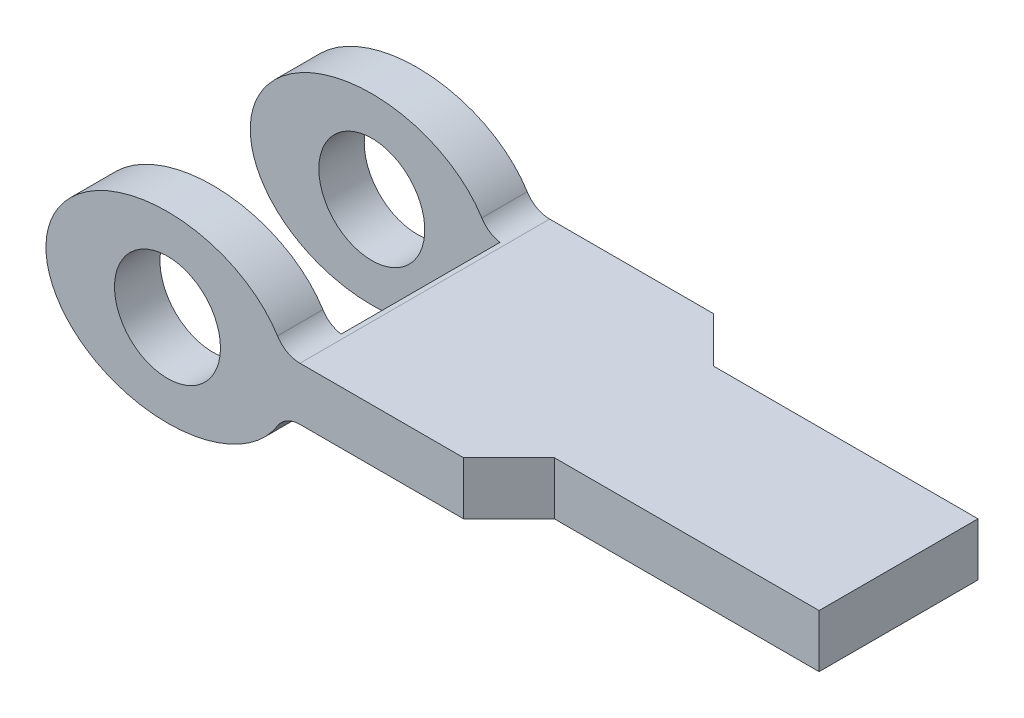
ISO-10303-21;
HEADER;
FILE_DESCRIPTION(('STEP AP214'),'2;1');
FILE_NAME('part.step','',(''),(''),'','','');
FILE_SCHEMA(('AUTOMOTIVE_DESIGN { 1 0 10303 214 1 1 1 1 }'));
ENDSEC;
DATA;
#1=APPLICATION_CONTEXT('core data for automotive mechanical design processes');
#2=APPLICATION_PROTOCOL_DEFINITION('international standard','automotive_design',2000,#1);
#3=PRODUCT_CONTEXT('',#1,'mechanical');
#4=PRODUCT('Part','Part','',(#3));
#5=PRODUCT_RELATED_PRODUCT_CATEGORY('part','',(#4));
#6=PRODUCT_DEFINITION_FORMATION('','',#4);
#7=PRODUCT_DEFINITION_CONTEXT('part definition',#1,'design');
#8=PRODUCT_DEFINITION('design','',#6,#7);
#9=PRODUCT_DEFINITION_SHAPE('','',#8);
#10=(LENGTH_UNIT() NAMED_UNIT(*) SI_UNIT(.MILLI.,.METRE.));
#11=(NAMED_UNIT(*) PLANE_ANGLE_UNIT() SI_UNIT($,.RADIAN.));
#12=(NAMED_UNIT(*) SI_UNIT($,.STERADIAN.) SOLID_ANGLE_UNIT());
#13=UNCERTAINTY_MEASURE_WITH_UNIT(LENGTH_MEASURE(1.E-05),#10,'distance_accuracy_value','');
#14=(GEOMETRIC_REPRESENTATION_CONTEXT(3) GLOBAL_UNCERTAINTY_ASSIGNED_CONTEXT((#13)) GLOBAL_UNIT_ASSIGNED_CONTEXT((#10,
#11,#12)) REPRESENTATION_CONTEXT('',''));
#15=CARTESIAN_POINT('',(0.,0.,0.));
#16=DIRECTION('',(0.,0.,1.));
#17=DIRECTION('',(1.,0.,0.));
#18=AXIS2_PLACEMENT_3D('',#15,#16,#17);
#19=CARTESIAN_POINT('',(0.,0.,9.42857142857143));
#20=DIRECTION('',(0.,0.,1.));
#21=DIRECTION('',(-1.,0.,0.));
#22=AXIS2_PLACEMENT_3D('',#19,#20,#21);
#23=ELLIPSE('',#22,9.17796127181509,6.91666666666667);
#24=DIRECTION('',(0.,0.,-1.));
#25=VECTOR('',#24,1.);
#26=SURFACE_OF_LINEAR_EXTRUSION('',#23,#25);
#27=CARTESIAN_POINT('',(0.,0.,-6.));
#28=DIRECTION('',(0.,0.,1.));
#29=DIRECTION('',(-1.,0.,0.));
#30=AXIS2_PLACEMENT_3D('',#27,#28,#29);
#31=ELLIPSE('',#30,9.17796127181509,6.91666666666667);
#32=CARTESIAN_POINT('',(8.30648200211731,-2.94174524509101,-6.));
#33=VERTEX_POINT('',#32);
#34=CARTESIAN_POINT('',(8.30648200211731,2.94174524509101,-6.));
#35=VERTEX_POINT('',#34);
#36=EDGE_CURVE('E171',#33,#35,#31,.F.);
#37=ORIENTED_EDGE('',*,*,#36,.T.);
#38=DIRECTION('',(0.,0.,-1.));
#39=VECTOR('',#38,1.);
#40=CARTESIAN_POINT('',(8.30648200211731,2.94174524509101,9.42857142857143));
#41=LINE('',#40,#39);
#42=CARTESIAN_POINT('',(8.30648200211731,2.94174524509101,-9.42857142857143));
#43=VERTEX_POINT('',#42);
#44=EDGE_CURVE('E278',#35,#43,#41,.T.);
#45=ORIENTED_EDGE('',*,*,#44,.T.);
#46=CARTESIAN_POINT('',(0.,0.,-9.42857142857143));
#47=DIRECTION('',(0.,0.,1.));
#48=DIRECTION('',(-1.,0.,0.));
#49=AXIS2_PLACEMENT_3D('',#46,#47,#48);
#50=ELLIPSE('',#49,9.17796127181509,6.91666666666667);
#51=CARTESIAN_POINT('',(8.30648200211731,-2.94174524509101,-9.42857142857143));
#52=VERTEX_POINT('',#51);
#53=EDGE_CURVE('E232',#43,#52,#50,.T.);
#54=ORIENTED_EDGE('',*,*,#53,.T.);
#55=DIRECTION('',(0.,0.,-1.));
#56=VECTOR('',#55,1.);
#57=CARTESIAN_POINT('',(8.30648200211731,-2.94174524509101,9.42857142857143));
#58=LINE('',#57,#56);
#59=EDGE_CURVE('E242',#33,#52,#58,.T.);
#60=ORIENTED_EDGE('',*,*,#59,.F.);
#61=EDGE_LOOP('',(#37,#45,#54,#60));
#62=FACE_BOUND('',#61,.T.);
#63=ADVANCED_FACE('F32',(#62),#26,.F.);
#64=CARTESIAN_POINT('',(0.,0.,9.42857142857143));
#65=DIRECTION('',(0.,0.,-1.));
#66=DIRECTION('',(-1.,0.,0.));
#67=AXIS2_PLACEMENT_3D('',#64,#65,#66);
#68=CYLINDRICAL_SURFACE('',#67,4.);
#69=CARTESIAN_POINT('',(0.,0.,-6.));
#70=DIRECTION('',(0.,0.,-1.));
#71=DIRECTION('',(-1.,0.,0.));
#72=AXIS2_PLACEMENT_3D('',#69,#70,#71);
#73=CIRCLE('',#72,4.);
#74=CARTESIAN_POINT('',(-4.,0.,-6.));
#75=VERTEX_POINT('',#74);
#76=EDGE_CURVE('E168',#75,#75,#73,.T.);
#77=ORIENTED_EDGE('',*,*,#76,.F.);
#78=EDGE_LOOP('',(#77));
#79=FACE_BOUND('',#78,.T.);
#80=CARTESIAN_POINT('',(0.,0.,-9.42857142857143));
#81=DIRECTION('',(0.,0.,1.));
#82=DIRECTION('',(1.,0.,0.));
#83=AXIS2_PLACEMENT_3D('',#80,#81,#82);
#84=CIRCLE('',#83,4.);
#85=CARTESIAN_POINT('',(4.,0.,-9.42857142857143));
#86=VERTEX_POINT('',#85);
#87=EDGE_CURVE('E221',#86,#86,#84,.T.);
#88=ORIENTED_EDGE('',*,*,#87,.F.);
#89=EDGE_LOOP('',(#88));
#90=FACE_BOUND('',#89,.T.);
#91=ADVANCED_FACE('F266',(#79,#90),#68,.F.);
#92=CARTESIAN_POINT('',(0.,0.,9.42857142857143));
#93=DIRECTION('',(0.,0.,1.));
#94=DIRECTION('',(1.,0.,0.));
#95=AXIS2_PLACEMENT_3D('',#92,#93,#94);
#96=PLANE('',#95);
#97=DIRECTION('',(0.,1.,0.));
#98=VECTOR('',#97,1.);
#99=CARTESIAN_POINT('',(22.3559225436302,-6.91666666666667,9.42857142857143));
#100=LINE('',#99,#98);
#101=CARTESIAN_POINT('',(22.3559225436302,-2.,9.42857142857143));
#102=VERTEX_POINT('',#101);
#103=CARTESIAN_POINT('',(22.3559225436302,2.,9.42857142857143));
#104=VERTEX_POINT('',#103);
#105=EDGE_CURVE('E140',#102,#104,#100,.T.);
#106=ORIENTED_EDGE('',*,*,#105,.T.);
#107=DIRECTION('',(-1.,0.,0.));
#108=VECTOR('',#107,1.);
#109=CARTESIAN_POINT('',(10.0035668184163,2.,9.42857142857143));
#110=LINE('',#109,#108);
#111=CARTESIAN_POINT('',(10.0035668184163,2.,9.42857142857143));
#112=VERTEX_POINT('',#111);
#113=EDGE_CURVE('E235',#104,#112,#110,.T.);
#114=ORIENTED_EDGE('',*,*,#113,.T.);
#115=CARTESIAN_POINT('',(10.0035668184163,4.,9.42857142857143));
#116=DIRECTION('',(0.,0.,-1.));
#117=DIRECTION('',(-1.,0.,0.));
#118=AXIS2_PLACEMENT_3D('',#115,#116,#117);
#119=CIRCLE('',#118,2.);
#120=CARTESIAN_POINT('',(8.30648200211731,2.94174524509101,9.42857142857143));
#121=VERTEX_POINT('',#120);
#122=EDGE_CURVE('E237',#112,#121,#119,.T.);
#123=ORIENTED_EDGE('',*,*,#122,.T.);
#124=CARTESIAN_POINT('',(8.30648200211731,-2.94174524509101,9.42857142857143));
#125=VERTEX_POINT('',#124);
#126=EDGE_CURVE('E239',#121,#125,#23,.T.);
#127=ORIENTED_EDGE('',*,*,#126,.T.);
#128=CARTESIAN_POINT('',(10.0035668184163,-4.,9.42857142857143));
#129=DIRECTION('',(0.,0.,-1.));
#130=DIRECTION('',(1.,0.,0.));
#131=AXIS2_PLACEMENT_3D('',#128,#129,#130);
#132=CIRCLE('',#131,2.);
#133=CARTESIAN_POINT('',(10.0035668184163,-2.,9.42857142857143));
#134=VERTEX_POINT('',#133);
#135=EDGE_CURVE('E228',#125,#134,#132,.T.);
#136=ORIENTED_EDGE('',*,*,#135,.T.);
#137=DIRECTION('',(1.,0.,0.));
#138=VECTOR('',#137,1.);
#139=CARTESIAN_POINT('',(45.7767491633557,-2.,9.42857142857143));
#140=LINE('',#139,#138);
#141=EDGE_CURVE('E231',#134,#102,#140,.T.);
#142=ORIENTED_EDGE('',*,*,#141,.T.);
#143=EDGE_LOOP('',(#106,#114,#123,#127,#136,#142));
#144=FACE_BOUND('',#143,.T.);
#145=CARTESIAN_POINT('',(0.,0.,9.42857142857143));
#146=DIRECTION('',(0.,0.,1.));
#147=DIRECTION('',(1.,0.,0.));
#148=AXIS2_PLACEMENT_3D('',#145,#146,#147);
#149=CIRCLE('',#148,4.);
#150=CARTESIAN_POINT('',(4.,0.,9.42857142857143));
#151=VERTEX_POINT('',#150);
#152=EDGE_CURVE('E222',#151,#151,#149,.T.);
#153=ORIENTED_EDGE('',*,*,#152,.F.);
#154=EDGE_LOOP('',(#153));
#155=FACE_BOUND('',#154,.T.);
#156=ADVANCED_FACE('F271',(#144,#155),#96,.T.);
#157=CARTESIAN_POINT('',(0.,0.,-9.42857142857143));
#158=DIRECTION('',(0.,0.,1.));
#159=DIRECTION('',(1.,0.,0.));
#160=AXIS2_PLACEMENT_3D('',#157,#158,#159);
#161=PLANE('',#160);
#162=DIRECTION('',(-1.,0.,0.));
#163=VECTOR('',#162,1.);
#164=CARTESIAN_POINT('',(10.0035668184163,2.,-9.42857142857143));
#165=LINE('',#164,#163);
#166=CARTESIAN_POINT('',(22.3559225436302,2.,-9.42857142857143));
#167=VERTEX_POINT('',#166);
#168=CARTESIAN_POINT('',(10.0035668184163,2.,-9.42857142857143));
#169=VERTEX_POINT('',#168);
#170=EDGE_CURVE('E300',#167,#169,#165,.T.);
#171=ORIENTED_EDGE('',*,*,#170,.F.);
#172=DIRECTION('',(0.,1.,0.));
#173=VECTOR('',#172,1.);
#174=CARTESIAN_POINT('',(22.3559225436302,-6.91666666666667,-9.42857142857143));
#175=LINE('',#174,#173);
#176=CARTESIAN_POINT('',(22.3559225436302,-2.,-9.42857142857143));
#177=VERTEX_POINT('',#176);
#178=EDGE_CURVE('E55',#177,#167,#175,.T.);
#179=ORIENTED_EDGE('',*,*,#178,.F.);
#180=DIRECTION('',(1.,0.,0.));
#181=VECTOR('',#180,1.);
#182=CARTESIAN_POINT('',(45.7767491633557,-2.,-9.42857142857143));
#183=LINE('',#182,#181);
#184=CARTESIAN_POINT('',(10.0035668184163,-2.,-9.42857142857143));
#185=VERTEX_POINT('',#184);
#186=EDGE_CURVE('E303',#185,#177,#183,.T.);
#187=ORIENTED_EDGE('',*,*,#186,.F.);
#188=CARTESIAN_POINT('',(10.0035668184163,-4.,-9.42857142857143));
#189=DIRECTION('',(0.,0.,-1.));
#190=DIRECTION('',(1.,0.,0.));
#191=AXIS2_PLACEMENT_3D('',#188,#189,#190);
#192=CIRCLE('',#191,2.);
#193=EDGE_CURVE('E225',#52,#185,#192,.T.);
#194=ORIENTED_EDGE('',*,*,#193,.F.);
#195=ORIENTED_EDGE('',*,*,#53,.F.);
#196=CARTESIAN_POINT('',(10.0035668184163,4.,-9.42857142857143));
#197=DIRECTION('',(0.,0.,-1.));
#198=DIRECTION('',(-1.,0.,0.));
#199=AXIS2_PLACEMENT_3D('',#196,#197,#198);
#200=CIRCLE('',#199,2.);
#201=EDGE_CURVE('E285',#169,#43,#200,.T.);
#202=ORIENTED_EDGE('',*,*,#201,.F.);
#203=EDGE_LOOP('',(#171,#179,#187,#194,#195,#202));
#204=FACE_BOUND('',#203,.T.);
#205=ORIENTED_EDGE('',*,*,#87,.T.);
#206=EDGE_LOOP('',(#205));
#207=FACE_BOUND('',#206,.T.);
#208=ADVANCED_FACE('F252',(#204,#207),#161,.F.);
#209=CARTESIAN_POINT('',(10.0035668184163,-4.,9.42857142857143));
#210=DIRECTION('',(0.,0.,-1.));
#211=DIRECTION('',(-1.,0.,0.));
#212=AXIS2_PLACEMENT_3D('',#209,#210,#211);
#213=CYLINDRICAL_SURFACE('',#212,2.);
#214=DIRECTION('',(0.,0.,-1.));
#215=VECTOR('',#214,1.);
#216=CARTESIAN_POINT('',(9.67796127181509,-2.02668273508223,9.42857142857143));
#217=LINE('',#216,#215);
#218=CARTESIAN_POINT('',(9.67796127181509,-2.02668273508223,6.));
#219=VERTEX_POINT('',#218);
#220=CARTESIAN_POINT('',(9.67796127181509,-2.02668273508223,-6.));
#221=VERTEX_POINT('',#220);
#222=EDGE_CURVE('E218',#219,#221,#217,.T.);
#223=ORIENTED_EDGE('',*,*,#222,.T.);
#224=CARTESIAN_POINT('',(10.0035668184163,-4.,-6.));
#225=DIRECTION('',(0.,0.,-1.));
#226=DIRECTION('',(-1.,0.,0.));
#227=AXIS2_PLACEMENT_3D('',#224,#225,#226);
#228=CIRCLE('',#227,2.);
#229=EDGE_CURVE('E215',#221,#33,#228,.F.);
#230=ORIENTED_EDGE('',*,*,#229,.T.);
#231=ORIENTED_EDGE('',*,*,#59,.T.);
#232=ORIENTED_EDGE('',*,*,#193,.T.);
#233=DIRECTION('',(0.,0.,-1.));
#234=VECTOR('',#233,1.);
#235=CARTESIAN_POINT('',(10.0035668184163,-2.,9.42857142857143));
#236=LINE('',#235,#234);
#237=EDGE_CURVE('E154',#134,#185,#236,.T.);
#238=ORIENTED_EDGE('',*,*,#237,.F.);
#239=ORIENTED_EDGE('',*,*,#135,.F.);
#240=CARTESIAN_POINT('',(8.30648200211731,-2.94174524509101,6.));
#241=VERTEX_POINT('',#240);
#242=EDGE_CURVE('E288',#125,#241,#58,.T.);
#243=ORIENTED_EDGE('',*,*,#242,.T.);
#244=CARTESIAN_POINT('',(10.0035668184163,-4.,6.));
#245=DIRECTION('',(0.,0.,1.));
#246=DIRECTION('',(1.,0.,0.));
#247=AXIS2_PLACEMENT_3D('',#244,#245,#246);
#248=CIRCLE('',#247,2.);
#249=EDGE_CURVE('E172',#241,#219,#248,.F.);
#250=ORIENTED_EDGE('',*,*,#249,.T.);
#251=EDGE_LOOP('',(#223,#230,#231,#232,#238,#239,#243,#250));
#252=FACE_BOUND('',#251,.T.);
#253=ADVANCED_FACE('F34',(#252),#213,.F.);
#254=CARTESIAN_POINT('',(45.7767491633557,-2.,9.42857142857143));
#255=DIRECTION('',(0.,1.,0.));
#256=DIRECTION('',(0.,0.,1.));
#257=AXIS2_PLACEMENT_3D('',#254,#255,#256);
#258=PLANE('',#257);
#259=DIRECTION('',(-1.,0.,0.));
#260=VECTOR('',#259,1.);
#261=CARTESIAN_POINT('',(45.7767491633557,-2.,6.));
#262=LINE('',#261,#260);
#263=CARTESIAN_POINT('',(45.7767491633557,-2.,6.));
#264=VERTEX_POINT('',#263);
#265=CARTESIAN_POINT('',(25.7844939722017,-2.,6.));
#266=VERTEX_POINT('',#265);
#267=EDGE_CURVE('E132',#264,#266,#262,.T.);
#268=ORIENTED_EDGE('',*,*,#267,.T.);
#269=DIRECTION('',(-0.707106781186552,0.,0.707106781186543));
#270=VECTOR('',#269,1.);
#271=CARTESIAN_POINT('',(34.0663358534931,-2.,-2.28184188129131));
#272=LINE('',#271,#270);
#273=EDGE_CURVE('E139',#266,#102,#272,.T.);
#274=ORIENTED_EDGE('',*,*,#273,.T.);
#275=ORIENTED_EDGE('',*,*,#141,.F.);
#276=ORIENTED_EDGE('',*,*,#237,.T.);
#277=ORIENTED_EDGE('',*,*,#186,.T.);
#278=DIRECTION('',(0.707106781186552,0.,0.707106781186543));
#279=VECTOR('',#278,1.);
#280=CARTESIAN_POINT('',(43.4949072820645,-2.,11.7104133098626));
#281=LINE('',#280,#279);
#282=CARTESIAN_POINT('',(25.7844939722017,-2.,-6.));
#283=VERTEX_POINT('',#282);
#284=EDGE_CURVE('E192',#177,#283,#281,.T.);
#285=ORIENTED_EDGE('',*,*,#284,.T.);
#286=DIRECTION('',(1.,0.,0.));
#287=VECTOR('',#286,1.);
#288=CARTESIAN_POINT('',(45.7767491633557,-2.,-6.));
#289=LINE('',#288,#287);
#290=CARTESIAN_POINT('',(45.7767491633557,-2.,-6.));
#291=VERTEX_POINT('',#290);
#292=EDGE_CURVE('E153',#283,#291,#289,.T.);
#293=ORIENTED_EDGE('',*,*,#292,.T.);
#294=DIRECTION('',(0.,0.,-1.));
#295=VECTOR('',#294,1.);
#296=CARTESIAN_POINT('',(45.7767491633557,-2.,9.42857142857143));
#297=LINE('',#296,#295);
#298=EDGE_CURVE('E146',#264,#291,#297,.T.);
#299=ORIENTED_EDGE('',*,*,#298,.F.);
#300=EDGE_LOOP('',(#268,#274,#275,#276,#277,#285,#293,#299));
#301=FACE_BOUND('',#300,.T.);
#302=ADVANCED_FACE('F151',(#301),#258,.F.);
#303=CARTESIAN_POINT('',(45.7767491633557,2.,9.42857142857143));
#304=DIRECTION('',(-1.,0.,0.));
#305=DIRECTION('',(0.,0.,1.));
#306=AXIS2_PLACEMENT_3D('',#303,#304,#305);
#307=PLANE('',#306);
#308=DIRECTION('',(0.,0.,-1.));
#309=VECTOR('',#308,1.);
#310=CARTESIAN_POINT('',(45.7767491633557,2.,9.42857142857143));
#311=LINE('',#310,#309);
#312=CARTESIAN_POINT('',(45.7767491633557,2.,6.));
#313=VERTEX_POINT('',#312);
#314=CARTESIAN_POINT('',(45.7767491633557,2.,-6.));
#315=VERTEX_POINT('',#314);
#316=EDGE_CURVE('E148',#313,#315,#311,.T.);
#317=ORIENTED_EDGE('',*,*,#316,.F.);
#318=DIRECTION('',(0.,1.,0.));
#319=VECTOR('',#318,1.);
#320=CARTESIAN_POINT('',(45.7767491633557,-6.91666666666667,6.));
#321=LINE('',#320,#319);
#322=EDGE_CURVE('E47',#264,#313,#321,.T.);
#323=ORIENTED_EDGE('',*,*,#322,.F.);
#324=ORIENTED_EDGE('',*,*,#298,.T.);
#325=DIRECTION('',(0.,1.,0.));
#326=VECTOR('',#325,1.);
#327=CARTESIAN_POINT('',(45.7767491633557,-6.91666666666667,-6.));
#328=LINE('',#327,#326);
#329=EDGE_CURVE('E190',#291,#315,#328,.T.);
#330=ORIENTED_EDGE('',*,*,#329,.T.);
#331=EDGE_LOOP('',(#317,#323,#324,#330));
#332=FACE_BOUND('',#331,.T.);
#333=ADVANCED_FACE('F144',(#332),#307,.F.);
#334=CARTESIAN_POINT('',(10.0035668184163,2.,9.42857142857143));
#335=DIRECTION('',(0.,-1.,0.));
#336=DIRECTION('',(0.,0.,-1.));
#337=AXIS2_PLACEMENT_3D('',#334,#335,#336);
#338=PLANE('',#337);
#339=ORIENTED_EDGE('',*,*,#113,.F.);
#340=DIRECTION('',(0.707106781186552,0.,-0.707106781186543));
#341=VECTOR('',#340,1.);
#342=CARTESIAN_POINT('',(16.1797446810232,2.,15.6047492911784));
#343=LINE('',#342,#341);
#344=CARTESIAN_POINT('',(25.7844939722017,2.,6.));
#345=VERTEX_POINT('',#344);
#346=EDGE_CURVE('E11',#104,#345,#343,.T.);
#347=ORIENTED_EDGE('',*,*,#346,.T.);
#348=DIRECTION('',(1.,0.,0.));
#349=VECTOR('',#348,1.);
#350=CARTESIAN_POINT('',(10.0035668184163,2.,6.));
#351=LINE('',#350,#349);
#352=EDGE_CURVE('E40',#345,#313,#351,.T.);
#353=ORIENTED_EDGE('',*,*,#352,.T.);
#354=ORIENTED_EDGE('',*,*,#316,.T.);
#355=DIRECTION('',(-1.,0.,0.));
#356=VECTOR('',#355,1.);
#357=CARTESIAN_POINT('',(10.0035668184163,2.,-6.));
#358=LINE('',#357,#356);
#359=CARTESIAN_POINT('',(25.7844939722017,2.,-6.));
#360=VERTEX_POINT('',#359);
#361=EDGE_CURVE('E177',#315,#360,#358,.T.);
#362=ORIENTED_EDGE('',*,*,#361,.T.);
#363=DIRECTION('',(-0.707106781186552,0.,-0.707106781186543));
#364=VECTOR('',#363,1.);
#365=CARTESIAN_POINT('',(25.6083161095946,2.,-6.17617786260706));
#366=LINE('',#365,#364);
#367=EDGE_CURVE('E175',#360,#167,#366,.T.);
#368=ORIENTED_EDGE('',*,*,#367,.T.);
#369=ORIENTED_EDGE('',*,*,#170,.T.);
#370=DIRECTION('',(0.,0.,-1.));
#371=VECTOR('',#370,1.);
#372=CARTESIAN_POINT('',(10.0035668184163,2.,9.42857142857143));
#373=LINE('',#372,#371);
#374=EDGE_CURVE('E159',#112,#169,#373,.T.);
#375=ORIENTED_EDGE('',*,*,#374,.F.);
#376=EDGE_LOOP('',(#339,#347,#353,#354,#362,#368,#369,#375));
#377=FACE_BOUND('',#376,.T.);
#378=ADVANCED_FACE('F181',(#377),#338,.F.);
#379=CARTESIAN_POINT('',(10.0035668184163,4.,9.42857142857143));
#380=DIRECTION('',(0.,0.,-1.));
#381=DIRECTION('',(-1.,0.,0.));
#382=AXIS2_PLACEMENT_3D('',#379,#380,#381);
#383=CYLINDRICAL_SURFACE('',#382,2.);
#384=ORIENTED_EDGE('',*,*,#44,.F.);
#385=CARTESIAN_POINT('',(10.0035668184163,4.,-6.));
#386=DIRECTION('',(0.,0.,-1.));
#387=DIRECTION('',(-1.,0.,0.));
#388=AXIS2_PLACEMENT_3D('',#385,#386,#387);
#389=CIRCLE('',#388,2.);
#390=CARTESIAN_POINT('',(9.67796127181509,2.02668273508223,-6.));
#391=VERTEX_POINT('',#390);
#392=EDGE_CURVE('E212',#35,#391,#389,.F.);
#393=ORIENTED_EDGE('',*,*,#392,.T.);
#394=DIRECTION('',(0.,0.,-1.));
#395=VECTOR('',#394,1.);
#396=CARTESIAN_POINT('',(9.67796127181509,2.02668273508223,9.42857142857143));
#397=LINE('',#396,#395);
#398=CARTESIAN_POINT('',(9.67796127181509,2.02668273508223,6.));
#399=VERTEX_POINT('',#398);
#400=EDGE_CURVE('E157',#391,#399,#397,.F.);
#401=ORIENTED_EDGE('',*,*,#400,.T.);
#402=CARTESIAN_POINT('',(10.0035668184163,4.,6.));
#403=DIRECTION('',(0.,0.,1.));
#404=DIRECTION('',(1.,0.,0.));
#405=AXIS2_PLACEMENT_3D('',#402,#403,#404);
#406=CIRCLE('',#405,2.);
#407=CARTESIAN_POINT('',(8.30648200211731,2.94174524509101,6.));
#408=VERTEX_POINT('',#407);
#409=EDGE_CURVE('E206',#399,#408,#406,.F.);
#410=ORIENTED_EDGE('',*,*,#409,.T.);
#411=EDGE_CURVE('E287',#121,#408,#41,.T.);
#412=ORIENTED_EDGE('',*,*,#411,.F.);
#413=ORIENTED_EDGE('',*,*,#122,.F.);
#414=ORIENTED_EDGE('',*,*,#374,.T.);
#415=ORIENTED_EDGE('',*,*,#201,.T.);
#416=EDGE_LOOP('',(#384,#393,#401,#410,#412,#413,#414,#415));
#417=FACE_BOUND('',#416,.T.);
#418=ADVANCED_FACE('F250',(#417),#383,.F.);
#419=ORIENTED_EDGE('',*,*,#411,.T.);
#420=CARTESIAN_POINT('',(0.,0.,6.));
#421=DIRECTION('',(0.,0.,1.));
#422=DIRECTION('',(-1.,0.,0.));
#423=AXIS2_PLACEMENT_3D('',#420,#421,#422);
#424=ELLIPSE('',#423,9.17796127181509,6.91666666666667);
#425=EDGE_CURVE('E166',#408,#241,#424,.T.);
#426=ORIENTED_EDGE('',*,*,#425,.T.);
#427=ORIENTED_EDGE('',*,*,#242,.F.);
#428=ORIENTED_EDGE('',*,*,#126,.F.);
#429=EDGE_LOOP('',(#419,#426,#427,#428));
#430=FACE_BOUND('',#429,.T.);
#431=ADVANCED_FACE('F245',(#430),#26,.F.);
#432=CARTESIAN_POINT('',(0.,0.,6.));
#433=DIRECTION('',(0.,0.,1.));
#434=DIRECTION('',(1.,0.,0.));
#435=AXIS2_PLACEMENT_3D('',#432,#433,#434);
#436=CIRCLE('',#435,4.);
#437=CARTESIAN_POINT('',(4.,0.,6.));
#438=VERTEX_POINT('',#437);
#439=EDGE_CURVE('E163',#438,#438,#436,.T.);
#440=ORIENTED_EDGE('',*,*,#439,.F.);
#441=EDGE_LOOP('',(#440));
#442=FACE_BOUND('',#441,.T.);
#443=ORIENTED_EDGE('',*,*,#152,.T.);
#444=EDGE_LOOP('',(#443));
#445=FACE_BOUND('',#444,.T.);
#446=ADVANCED_FACE('F249',(#442,#445),#68,.F.);
#447=CARTESIAN_POINT('',(9.67796127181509,-6.91666666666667,6.));
#448=DIRECTION('',(1.,0.,0.));
#449=DIRECTION('',(0.,0.,-1.));
#450=AXIS2_PLACEMENT_3D('',#447,#448,#449);
#451=PLANE('',#450);
#452=DIRECTION('',(0.,1.,0.));
#453=VECTOR('',#452,1.);
#454=CARTESIAN_POINT('',(9.67796127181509,-6.91666666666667,6.));
#455=LINE('',#454,#453);
#456=EDGE_CURVE('E199',#219,#399,#455,.T.);
#457=ORIENTED_EDGE('',*,*,#456,.T.);
#458=ORIENTED_EDGE('',*,*,#400,.F.);
#459=DIRECTION('',(0.,1.,0.));
#460=VECTOR('',#459,1.);
#461=CARTESIAN_POINT('',(9.67796127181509,-6.91666666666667,-6.));
#462=LINE('',#461,#460);
#463=EDGE_CURVE('E167',#221,#391,#462,.T.);
#464=ORIENTED_EDGE('',*,*,#463,.F.);
#465=ORIENTED_EDGE('',*,*,#222,.F.);
#466=EDGE_LOOP('',(#457,#458,#464,#465));
#467=FACE_BOUND('',#466,.T.);
#468=ADVANCED_FACE('F317',(#467),#451,.F.);
#469=CARTESIAN_POINT('',(9.67796127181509,-6.91666666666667,-6.));
#470=DIRECTION('',(0.,0.,-1.));
#471=DIRECTION('',(-1.,0.,0.));
#472=AXIS2_PLACEMENT_3D('',#469,#470,#471);
#473=PLANE('',#472);
#474=ORIENTED_EDGE('',*,*,#76,.T.);
#475=EDGE_LOOP('',(#474));
#476=FACE_BOUND('',#475,.T.);
#477=ORIENTED_EDGE('',*,*,#463,.T.);
#478=ORIENTED_EDGE('',*,*,#392,.F.);
#479=ORIENTED_EDGE('',*,*,#36,.F.);
#480=ORIENTED_EDGE('',*,*,#229,.F.);
#481=EDGE_LOOP('',(#477,#478,#479,#480));
#482=FACE_BOUND('',#481,.T.);
#483=ADVANCED_FACE('F281',(#476,#482),#473,.F.);
#484=CARTESIAN_POINT('',(9.67796127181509,-6.91666666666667,6.));
#485=DIRECTION('',(0.,0.,1.));
#486=DIRECTION('',(1.,0.,0.));
#487=AXIS2_PLACEMENT_3D('',#484,#485,#486);
#488=PLANE('',#487);
#489=ORIENTED_EDGE('',*,*,#439,.T.);
#490=EDGE_LOOP('',(#489));
#491=FACE_BOUND('',#490,.T.);
#492=ORIENTED_EDGE('',*,*,#425,.F.);
#493=ORIENTED_EDGE('',*,*,#409,.F.);
#494=ORIENTED_EDGE('',*,*,#456,.F.);
#495=ORIENTED_EDGE('',*,*,#249,.F.);
#496=EDGE_LOOP('',(#492,#493,#494,#495));
#497=FACE_BOUND('',#496,.T.);
#498=ADVANCED_FACE('F314',(#491,#497),#488,.F.);
#499=CARTESIAN_POINT('',(25.7844939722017,-6.91666666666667,-6.));
#500=DIRECTION('',(0.,0.,1.));
#501=DIRECTION('',(1.,0.,0.));
#502=AXIS2_PLACEMENT_3D('',#499,#500,#501);
#503=PLANE('',#502);
#504=DIRECTION('',(0.,1.,0.));
#505=VECTOR('',#504,1.);
#506=CARTESIAN_POINT('',(25.7844939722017,-6.91666666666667,-6.));
#507=LINE('',#506,#505);
#508=EDGE_CURVE('E193',#283,#360,#507,.T.);
#509=ORIENTED_EDGE('',*,*,#508,.T.);
#510=ORIENTED_EDGE('',*,*,#361,.F.);
#511=ORIENTED_EDGE('',*,*,#329,.F.);
#512=ORIENTED_EDGE('',*,*,#292,.F.);
#513=EDGE_LOOP('',(#509,#510,#511,#512));
#514=FACE_BOUND('',#513,.T.);
#515=ADVANCED_FACE('F330',(#514),#503,.F.);
#516=CARTESIAN_POINT('',(22.3559225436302,-6.91666666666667,-9.42857142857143));
#517=DIRECTION('',(-0.707106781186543,0.,0.707106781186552));
#518=DIRECTION('',(0.707106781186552,0.,0.707106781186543));
#519=AXIS2_PLACEMENT_3D('',#516,#517,#518);
#520=PLANE('',#519);
#521=ORIENTED_EDGE('',*,*,#178,.T.);
#522=ORIENTED_EDGE('',*,*,#367,.F.);
#523=ORIENTED_EDGE('',*,*,#508,.F.);
#524=ORIENTED_EDGE('',*,*,#284,.F.);
#525=EDGE_LOOP('',(#521,#522,#523,#524));
#526=FACE_BOUND('',#525,.T.);
#527=ADVANCED_FACE('F397',(#526),#520,.F.);
#528=CARTESIAN_POINT('',(22.3559225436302,-6.91666666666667,9.42857142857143));
#529=DIRECTION('',(-0.707106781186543,0.,-0.707106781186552));
#530=DIRECTION('',(-0.707106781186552,0.,0.707106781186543));
#531=AXIS2_PLACEMENT_3D('',#528,#529,#530);
#532=PLANE('',#531);
#533=DIRECTION('',(0.,1.,0.));
#534=VECTOR('',#533,1.);
#535=CARTESIAN_POINT('',(25.7844939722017,-6.91666666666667,6.));
#536=LINE('',#535,#534);
#537=EDGE_CURVE('E135',#266,#345,#536,.T.);
#538=ORIENTED_EDGE('',*,*,#537,.T.);
#539=ORIENTED_EDGE('',*,*,#346,.F.);
#540=ORIENTED_EDGE('',*,*,#105,.F.);
#541=ORIENTED_EDGE('',*,*,#273,.F.);
#542=EDGE_LOOP('',(#538,#539,#540,#541));
#543=FACE_BOUND('',#542,.T.);
#544=ADVANCED_FACE('F184',(#543),#532,.F.);
#545=CARTESIAN_POINT('',(25.7844939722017,-6.91666666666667,6.));
#546=DIRECTION('',(0.,0.,-1.));
#547=DIRECTION('',(-1.,0.,0.));
#548=AXIS2_PLACEMENT_3D('',#545,#546,#547);
#549=PLANE('',#548);
#550=ORIENTED_EDGE('',*,*,#322,.T.);
#551=ORIENTED_EDGE('',*,*,#352,.F.);
#552=ORIENTED_EDGE('',*,*,#537,.F.);
#553=ORIENTED_EDGE('',*,*,#267,.F.);
#554=EDGE_LOOP('',(#550,#551,#552,#553));
#555=FACE_BOUND('',#554,.T.);
#556=ADVANCED_FACE('F133',(#555),#549,.F.);
#557=CLOSED_SHELL('',(#63,#91,#156,#208,#253,#302,#333,#378,#418,#431,#446,#468,#483,#498,#515,
#527,#544,#556));
#558=MANIFOLD_SOLID_BREP('B2',#557);
#559=ADVANCED_BREP_SHAPE_REPRESENTATION('',(#18,#558),#14);
#560=SHAPE_DEFINITION_REPRESENTATION(#9,#559);
ENDSEC;
END-ISO-10303-21;
